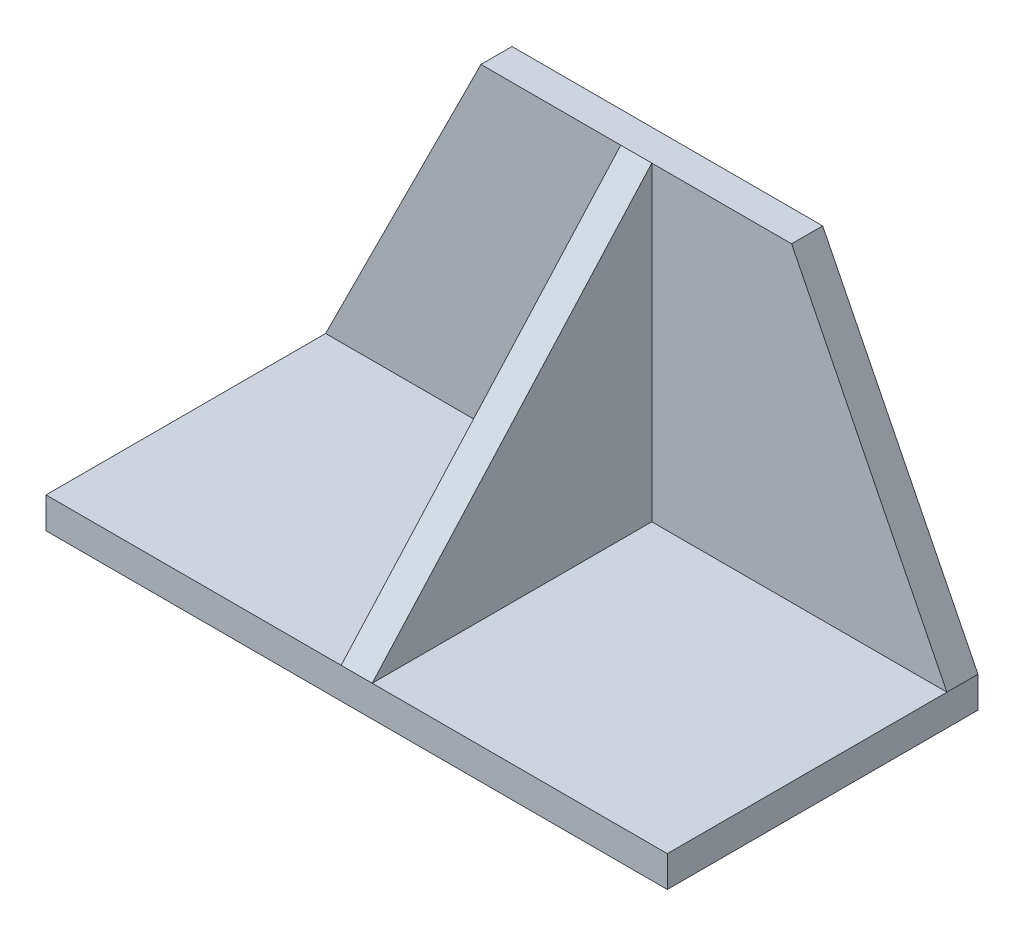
from build123d import *

# Parameters (mm, degrees)
SKETCH1_W      = 50.8
SKETCH1_H      = 25.4
EXTRUDE1_DEPTH = 2.54
EXTRUDE2_DEPTH = 2.54
RIB4_REACH     = 40.1
SKETCH4_WALL_W = 112.37220508
SKETCH4_WALL_H = 2.54


with BuildPart() as part:
    # Sketch1 → Extrude1 (new body)
    with BuildSketch(Plane(origin=(0, 0, 0), x_dir=(1, 0, 0), z_dir=(0, 1, 0))):
        Rectangle(SKETCH1_W, SKETCH1_H)
    extrude(amount=-EXTRUDE1_DEPTH)

    # Sketch2 → Extrude2 (add)
    with BuildSketch(Plane(origin=(0, 0, -12.7), x_dir=(-1, 0, 0), z_dir=(0, 0, -1))):
        Polygon((-25.4, 0), (25.4, 0), (12.7, 25.4), (-12.7, 25.4), align=None)
    extrude(amount=-EXTRUDE2_DEPTH)

    # Sketch4 wall → Rib4 (add, up to next)
    with BuildSketch(Plane(origin=(0, 12.7, 1.27), x_dir=(0, 0.743294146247, -0.668964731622), z_dir=(0, 0.668964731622, 0.743294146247)), mode=Mode.PRIVATE) as rib4_sk1:
        Rectangle(SKETCH4_WALL_W, SKETCH4_WALL_H)
    rib4_tool1 = extrude(rib4_sk1.sketch, amount=-RIB4_REACH, mode=Mode.PRIVATE) - part.part
    add(rib4_tool1.solids().sort_by_distance((0, 12.7, 1.27))[0])


solid = part.part
